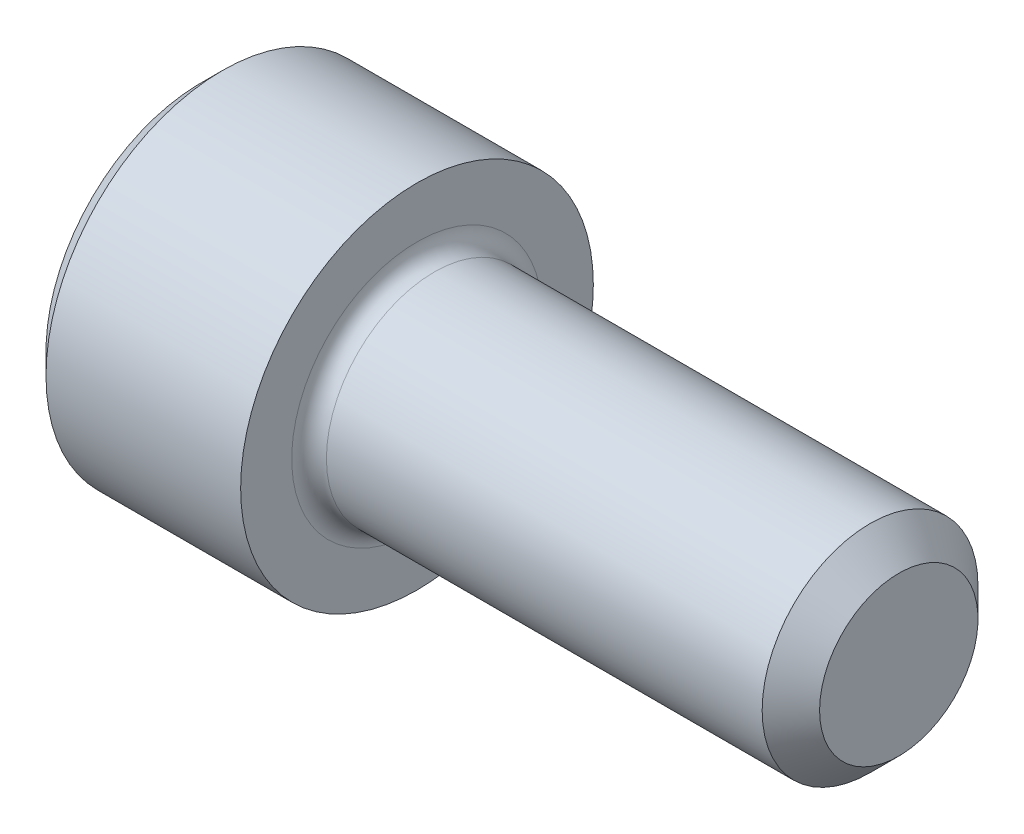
ISO-10303-21;
HEADER;
FILE_DESCRIPTION(('STEP AP214'),'2;1');
FILE_NAME('part.step','',(''),(''),'','','');
FILE_SCHEMA(('AUTOMOTIVE_DESIGN { 1 0 10303 214 1 1 1 1 }'));
ENDSEC;
DATA;
#1=APPLICATION_CONTEXT('core data for automotive mechanical design processes');
#2=APPLICATION_PROTOCOL_DEFINITION('international standard','automotive_design',2000,#1);
#3=PRODUCT_CONTEXT('',#1,'mechanical');
#4=PRODUCT('Part','Part','',(#3));
#5=PRODUCT_RELATED_PRODUCT_CATEGORY('part','',(#4));
#6=PRODUCT_DEFINITION_FORMATION('','',#4);
#7=PRODUCT_DEFINITION_CONTEXT('part definition',#1,'design');
#8=PRODUCT_DEFINITION('design','',#6,#7);
#9=PRODUCT_DEFINITION_SHAPE('','',#8);
#10=(LENGTH_UNIT() NAMED_UNIT(*) SI_UNIT(.MILLI.,.METRE.));
#11=(NAMED_UNIT(*) PLANE_ANGLE_UNIT() SI_UNIT($,.RADIAN.));
#12=(NAMED_UNIT(*) SI_UNIT($,.STERADIAN.) SOLID_ANGLE_UNIT());
#13=UNCERTAINTY_MEASURE_WITH_UNIT(LENGTH_MEASURE(1.E-05),#10,'distance_accuracy_value','');
#14=(GEOMETRIC_REPRESENTATION_CONTEXT(3) GLOBAL_UNCERTAINTY_ASSIGNED_CONTEXT((#13)) GLOBAL_UNIT_ASSIGNED_CONTEXT((#10,
#11,#12)) REPRESENTATION_CONTEXT('',''));
#15=CARTESIAN_POINT('',(0.,0.,0.));
#16=DIRECTION('',(0.,0.,1.));
#17=DIRECTION('',(1.,0.,0.));
#18=AXIS2_PLACEMENT_3D('',#15,#16,#17);
#19=CARTESIAN_POINT('',(0.,0.,0.));
#20=DIRECTION('',(-0.999999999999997,0.,0.));
#21=DIRECTION('',(0.,0.,1.));
#22=AXIS2_PLACEMENT_3D('',#19,#20,#21);
#23=PLANE('',#22);
#24=DIRECTION('',(0.,-0.5,0.866025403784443));
#25=VECTOR('',#24,1.);
#26=CARTESIAN_POINT('',(0.,1.37848150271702,-1.52655665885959E-13));
#27=LINE('',#26,#25);
#28=CARTESIAN_POINT('',(0.,1.37848150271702,-1.52655665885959E-13));
#29=VERTEX_POINT('',#28);
#30=CARTESIAN_POINT('',(0.,0.689240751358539,1.19380000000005));
#31=VERTEX_POINT('',#30);
#32=EDGE_CURVE('E315',#29,#31,#27,.T.);
#33=ORIENTED_EDGE('',*,*,#32,.T.);
#34=DIRECTION('',(0.,1.00000000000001,0.));
#35=VECTOR('',#34,1.);
#36=CARTESIAN_POINT('',(2.32452945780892E-13,-0.689240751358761,1.19380000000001));
#37=LINE('',#36,#35);
#38=CARTESIAN_POINT('',(2.32452945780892E-13,-0.689240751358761,1.19380000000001));
#39=VERTEX_POINT('',#38);
#40=EDGE_CURVE('E169',#39,#31,#37,.T.);
#41=ORIENTED_EDGE('',*,*,#40,.F.);
#42=DIRECTION('',(0.,-0.500000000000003,-0.86602540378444));
#43=VECTOR('',#42,1.);
#44=CARTESIAN_POINT('',(2.32452945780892E-13,-0.689240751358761,1.19380000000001));
#45=LINE('',#44,#43);
#46=CARTESIAN_POINT('',(0.,-1.37848150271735,0.));
#47=VERTEX_POINT('',#46);
#48=EDGE_CURVE('E319',#39,#47,#45,.T.);
#49=ORIENTED_EDGE('',*,*,#48,.T.);
#50=DIRECTION('',(0.,0.5,-0.866025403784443));
#51=VECTOR('',#50,1.);
#52=CARTESIAN_POINT('',(0.,-1.37848150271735,0.));
#53=LINE('',#52,#51);
#54=CARTESIAN_POINT('',(0.,-0.689240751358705,-1.19379999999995));
#55=VERTEX_POINT('',#54);
#56=EDGE_CURVE('E322',#47,#55,#53,.T.);
#57=ORIENTED_EDGE('',*,*,#56,.T.);
#58=DIRECTION('',(0.,-1.00000000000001,0.));
#59=VECTOR('',#58,1.);
#60=CARTESIAN_POINT('',(0.,0.689240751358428,-1.19380000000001));
#61=LINE('',#60,#59);
#62=CARTESIAN_POINT('',(0.,0.689240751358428,-1.19380000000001));
#63=VERTEX_POINT('',#62);
#64=EDGE_CURVE('E325',#63,#55,#61,.T.);
#65=ORIENTED_EDGE('',*,*,#64,.F.);
#66=DIRECTION('',(0.,-0.500000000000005,-0.866025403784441));
#67=VECTOR('',#66,1.);
#68=CARTESIAN_POINT('',(0.,1.37848150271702,-1.52655665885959E-13));
#69=LINE('',#68,#67);
#70=EDGE_CURVE('E164',#29,#63,#69,.T.);
#71=ORIENTED_EDGE('',*,*,#70,.F.);
#72=EDGE_LOOP('',(#33,#41,#49,#57,#65,#71));
#73=FACE_BOUND('',#72,.T.);
#74=CARTESIAN_POINT('',(0.,0.,0.));
#75=DIRECTION('',(-0.999999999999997,0.,0.));
#76=DIRECTION('',(0.,0.,1.));
#77=AXIS2_PLACEMENT_3D('',#74,#75,#76);
#78=CIRCLE('',#77,2.0447);
#79=CARTESIAN_POINT('',(0.,0.,-2.0447));
#80=VERTEX_POINT('',#79);
#81=EDGE_CURVE('E202',#80,#80,#78,.T.);
#82=ORIENTED_EDGE('',*,*,#81,.T.);
#83=EDGE_LOOP('',(#82));
#84=FACE_BOUND('',#83,.T.);
#85=ADVANCED_FACE('F54',(#73,#84),#23,.T.);
#86=CARTESIAN_POINT('',(0.,0.,0.));
#87=DIRECTION('',(0.999999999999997,0.,0.));
#88=DIRECTION('',(0.,0.,-1.));
#89=AXIS2_PLACEMENT_3D('',#86,#87,#88);
#90=CONICAL_SURFACE('',#89,2.0447,0.785398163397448);
#91=CARTESIAN_POINT('',(0.279400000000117,-2.22044604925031E-13,0.));
#92=DIRECTION('',(-0.999999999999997,0.,0.));
#93=DIRECTION('',(0.,0.,1.));
#94=AXIS2_PLACEMENT_3D('',#91,#92,#93);
#95=CIRCLE('',#94,2.3241);
#96=CARTESIAN_POINT('',(0.279400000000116,0.,-2.32410000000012));
#97=VERTEX_POINT('',#96);
#98=EDGE_CURVE('E198',#97,#97,#95,.T.);
#99=CARTESIAN_POINT('',(0.279400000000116,0.,-2.32410000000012));
#100=CARTESIAN_POINT('',(0.276489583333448,0.,-2.32118958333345));
#101=CARTESIAN_POINT('',(0.273579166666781,0.,-2.31827916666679));
#102=CARTESIAN_POINT('',(0.267758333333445,0.,-2.31245833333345));
#103=CARTESIAN_POINT('',(0.264847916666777,0.,-2.30954791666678));
#104=CARTESIAN_POINT('',(0.259027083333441,0.,-2.30372708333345));
#105=CARTESIAN_POINT('',(0.256116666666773,0.,-2.30081666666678));
#106=CARTESIAN_POINT('',(0.250295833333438,0.,-2.29499583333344));
#107=CARTESIAN_POINT('',(0.24738541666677,0.,-2.29208541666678));
#108=CARTESIAN_POINT('',(0.241564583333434,0.,-2.28626458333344));
#109=CARTESIAN_POINT('',(0.238654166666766,0.,-2.28335416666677));
#110=CARTESIAN_POINT('',(0.23283333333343,0.,-2.27753333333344));
#111=CARTESIAN_POINT('',(0.229922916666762,0.,-2.27462291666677));
#112=CARTESIAN_POINT('',(0.224102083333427,0.,-2.26880208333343));
#113=CARTESIAN_POINT('',(0.221191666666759,0.,-2.26589166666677));
#114=CARTESIAN_POINT('',(0.215370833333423,0.,-2.26007083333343));
#115=CARTESIAN_POINT('',(0.212460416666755,0.,-2.25716041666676));
#116=CARTESIAN_POINT('',(0.206639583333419,0.,-2.25133958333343));
#117=CARTESIAN_POINT('',(0.203729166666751,0.,-2.24842916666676));
#118=CARTESIAN_POINT('',(0.197908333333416,0.,-2.24260833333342));
#119=CARTESIAN_POINT('',(0.194997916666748,0.,-2.23969791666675));
#120=CARTESIAN_POINT('',(0.189177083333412,0.,-2.23387708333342));
#121=CARTESIAN_POINT('',(0.186266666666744,0.,-2.23096666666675));
#122=CARTESIAN_POINT('',(0.180445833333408,0.,-2.22514583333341));
#123=CARTESIAN_POINT('',(0.17753541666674,0.,-2.22223541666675));
#124=CARTESIAN_POINT('',(0.171714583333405,0.,-2.21641458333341));
#125=CARTESIAN_POINT('',(0.168804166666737,0.,-2.21350416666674));
#126=CARTESIAN_POINT('',(0.162983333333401,0.,-2.20768333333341));
#127=CARTESIAN_POINT('',(0.160072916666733,0.,-2.20477291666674));
#128=CARTESIAN_POINT('',(0.154252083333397,0.,-2.1989520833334));
#129=CARTESIAN_POINT('',(0.15134166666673,0.,-2.19604166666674));
#130=CARTESIAN_POINT('',(0.145520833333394,0.,-2.1902208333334));
#131=CARTESIAN_POINT('',(0.142610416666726,0.,-2.18731041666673));
#132=CARTESIAN_POINT('',(0.13678958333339,0.,-2.1814895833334));
#133=CARTESIAN_POINT('',(0.133879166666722,0.,-2.17857916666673));
#134=CARTESIAN_POINT('',(0.128058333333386,0.,-2.17275833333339));
#135=CARTESIAN_POINT('',(0.125147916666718,0.,-2.16984791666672));
#136=CARTESIAN_POINT('',(0.119327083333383,0.,-2.16402708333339));
#137=CARTESIAN_POINT('',(0.116416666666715,0.,-2.16111666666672));
#138=CARTESIAN_POINT('',(0.110595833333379,0.,-2.15529583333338));
#139=CARTESIAN_POINT('',(0.107685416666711,0.,-2.15238541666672));
#140=CARTESIAN_POINT('',(0.101864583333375,0.,-2.14656458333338));
#141=CARTESIAN_POINT('',(0.0989541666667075,0.,-2.14365416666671));
#142=CARTESIAN_POINT('',(0.0931333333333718,0.,-2.13783333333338));
#143=CARTESIAN_POINT('',(0.0902229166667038,0.,-2.13492291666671));
#144=CARTESIAN_POINT('',(0.0844020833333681,0.,-2.12910208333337));
#145=CARTESIAN_POINT('',(0.0814916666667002,0.,-2.12619166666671));
#146=CARTESIAN_POINT('',(0.0756708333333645,0.,-2.12037083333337));
#147=CARTESIAN_POINT('',(0.0727604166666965,0.,-2.1174604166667));
#148=CARTESIAN_POINT('',(0.0669395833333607,0.,-2.11163958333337));
#149=CARTESIAN_POINT('',(0.0640291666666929,0.,-2.1087291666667));
#150=CARTESIAN_POINT('',(0.0582083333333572,0.,-2.10290833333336));
#151=CARTESIAN_POINT('',(0.0552979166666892,0.,-2.0999979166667));
#152=CARTESIAN_POINT('',(0.0494770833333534,0.,-2.09417708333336));
#153=CARTESIAN_POINT('',(0.0465666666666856,0.,-2.09126666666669));
#154=CARTESIAN_POINT('',(0.0407458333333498,0.,-2.08544583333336));
#155=CARTESIAN_POINT('',(0.037835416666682,0.,-2.08253541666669));
#156=CARTESIAN_POINT('',(0.0320145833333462,0.,-2.07671458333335));
#157=CARTESIAN_POINT('',(0.0291041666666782,0.,-2.07380416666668));
#158=CARTESIAN_POINT('',(0.0232833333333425,0.,-2.06798333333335));
#159=CARTESIAN_POINT('',(0.0203729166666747,0.,-2.06507291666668));
#160=CARTESIAN_POINT('',(0.0145520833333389,0.,-2.05925208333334));
#161=CARTESIAN_POINT('',(0.011641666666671,0.,-2.05634166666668));
#162=CARTESIAN_POINT('',(0.00582083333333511,0.,-2.05052083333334));
#163=CARTESIAN_POINT('',(0.00291041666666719,0.,-2.04761041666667));
#164=CARTESIAN_POINT('',(0.,0.,-2.0447));
#165=B_SPLINE_CURVE_WITH_KNOTS('',3,(#99,#100,#101,#102,#103,#104,#105,#106,#107,#108,#109,#110,
#111,#112,#113,#114,#115,#116,#117,#118,#119,#120,#121,#122,#123,#124,#125,#126,#127,#128,#129,
#130,#131,#132,#133,#134,#135,#136,#137,#138,#139,#140,#141,#142,#143,#144,#145,#146,#147,#148,
#149,#150,#151,#152,#153,#154,#155,#156,#157,#158,#159,#160,#161,#162,#163,#164),.UNSPECIFIED.,
.F.,.F.,(4,2,2,2,2,2,2,2,2,2,2,2,2,2,2,2,2,2,2,2,2,2,2,2,2,2,2,2,2,2,2,2,4),(0.,
0.0123478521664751,0.0246957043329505,0.0370435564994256,0.049391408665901,0.0617392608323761,
0.0740871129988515,0.0864349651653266,0.098782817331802,0.111130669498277,0.123478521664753,
0.135826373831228,0.148174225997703,0.160522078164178,0.172869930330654,0.185217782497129,
0.197565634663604,0.20991348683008,0.222261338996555,0.23460919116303,0.246957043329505,
0.259304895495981,0.271652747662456,0.284000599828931,0.296348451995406,0.308696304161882,
0.321044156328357,0.333392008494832,0.345739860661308,0.358087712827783,0.370435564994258,
0.382783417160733,0.395131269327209),.UNSPECIFIED.);
#166=EDGE_CURVE('BSEAM226',#97,#80,#165,.T.);
#167=ORIENTED_EDGE('',*,*,#98,.T.);
#168=ORIENTED_EDGE('',*,*,#81,.F.);
#169=ORIENTED_EDGE('',*,*,#166,.T.);
#170=ORIENTED_EDGE('',*,*,#166,.F.);
#171=EDGE_LOOP('',(#167,#169,#168,#170));
#172=FACE_BOUND('',#171,.T.);
#173=ADVANCED_FACE('F226',(#172),#90,.T.);
#174=CARTESIAN_POINT('',(-31.7499999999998,-2.4980018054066E-13,-2.22044604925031E-13));
#175=DIRECTION('',(-0.999999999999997,0.,0.));
#176=DIRECTION('',(0.,0.,1.));
#177=AXIS2_PLACEMENT_3D('',#174,#175,#176);
#178=CYLINDRICAL_SURFACE('',#177,2.3241);
#179=CARTESIAN_POINT('',(2.8448,0.,-1.11022302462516E-13));
#180=DIRECTION('',(-0.999999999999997,0.,0.));
#181=DIRECTION('',(0.,0.,1.));
#182=AXIS2_PLACEMENT_3D('',#179,#180,#181);
#183=CIRCLE('',#182,2.3241);
#184=CARTESIAN_POINT('',(2.8448,0.,2.32409999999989));
#185=VERTEX_POINT('',#184);
#186=EDGE_CURVE('E194',#185,#185,#183,.T.);
#187=ORIENTED_EDGE('',*,*,#186,.T.);
#188=EDGE_LOOP('',(#187));
#189=FACE_BOUND('',#188,.T.);
#190=ORIENTED_EDGE('',*,*,#98,.F.);
#191=EDGE_LOOP('',(#190));
#192=FACE_BOUND('',#191,.T.);
#193=ADVANCED_FACE('F231',(#189,#192),#178,.T.);
#194=CARTESIAN_POINT('',(2.84480000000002,2.32409999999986,-1.11022302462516E-13));
#195=DIRECTION('',(0.999999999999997,0.,0.));
#196=DIRECTION('',(0.,0.,-1.));
#197=AXIS2_PLACEMENT_3D('',#194,#195,#196);
#198=PLANE('',#197);
#199=CARTESIAN_POINT('',(2.8448,0.,-1.11022302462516E-13));
#200=DIRECTION('',(0.999999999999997,0.,0.));
#201=DIRECTION('',(0.,0.,-1.));
#202=AXIS2_PLACEMENT_3D('',#199,#200,#201);
#203=CIRCLE('',#202,1.65099999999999);
#204=CARTESIAN_POINT('',(2.8448,0.,-1.65100000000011));
#205=VERTEX_POINT('',#204);
#206=EDGE_CURVE('E63',#205,#205,#203,.F.);
#207=ORIENTED_EDGE('',*,*,#206,.T.);
#208=EDGE_LOOP('',(#207));
#209=FACE_BOUND('',#208,.T.);
#210=ORIENTED_EDGE('',*,*,#186,.F.);
#211=EDGE_LOOP('',(#210));
#212=FACE_BOUND('',#211,.T.);
#213=ADVANCED_FACE('F210',(#209,#212),#198,.T.);
#214=CARTESIAN_POINT('',(-31.7499999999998,-2.4980018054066E-13,-2.22044604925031E-13));
#215=DIRECTION('',(-0.999999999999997,0.,0.));
#216=DIRECTION('',(0.,0.,1.));
#217=AXIS2_PLACEMENT_3D('',#214,#215,#216);
#218=CYLINDRICAL_SURFACE('',#217,1.42239999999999);
#219=CARTESIAN_POINT('',(3.07340000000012,-2.4980018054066E-13,-1.94289029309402E-13));
#220=DIRECTION('',(0.999999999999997,0.,0.));
#221=DIRECTION('',(0.,0.,-1.));
#222=AXIS2_PLACEMENT_3D('',#219,#220,#221);
#223=CIRCLE('',#222,1.42239999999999);
#224=CARTESIAN_POINT('',(3.07340000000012,-2.88047556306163E-13,1.42239999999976));
#225=VERTEX_POINT('',#224);
#226=EDGE_CURVE('E13',#225,#225,#223,.T.);
#227=CARTESIAN_POINT('',(8.8163400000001,0.,0.));
#228=DIRECTION('',(-0.999999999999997,0.,0.));
#229=DIRECTION('',(0.,0.,1.));
#230=AXIS2_PLACEMENT_3D('',#227,#228,#229);
#231=CIRCLE('',#230,1.42239999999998);
#232=CARTESIAN_POINT('',(8.8163400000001,-2.94250992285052E-13,1.42239999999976));
#233=VERTEX_POINT('',#232);
#234=EDGE_CURVE('E190',#233,#233,#231,.T.);
#235=CARTESIAN_POINT('',(3.07340000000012,-2.88047556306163E-13,1.42239999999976));
#236=CARTESIAN_POINT('',(3.13322229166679,-2.88112175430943E-13,1.42239999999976));
#237=CARTESIAN_POINT('',(3.19304458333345,-2.88176794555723E-13,1.42239999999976));
#238=CARTESIAN_POINT('',(3.31268916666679,-2.88306032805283E-13,1.42239999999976));
#239=CARTESIAN_POINT('',(3.37251145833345,-2.88370651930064E-13,1.42239999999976));
#240=CARTESIAN_POINT('',(3.49215604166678,-2.88499890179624E-13,1.42239999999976));
#241=CARTESIAN_POINT('',(3.55197833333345,-2.88564509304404E-13,1.42239999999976));
#242=CARTESIAN_POINT('',(3.67162291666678,-2.88693747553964E-13,1.42239999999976));
#243=CARTESIAN_POINT('',(3.73144520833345,-2.88758366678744E-13,1.42239999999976));
#244=CARTESIAN_POINT('',(3.85108979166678,-2.88887604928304E-13,1.42239999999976));
#245=CARTESIAN_POINT('',(3.91091208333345,-2.88952224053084E-13,1.42239999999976));
#246=CARTESIAN_POINT('',(4.03055666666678,-2.89081462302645E-13,1.42239999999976));
#247=CARTESIAN_POINT('',(4.09037895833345,-2.89146081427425E-13,1.42239999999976));
#248=CARTESIAN_POINT('',(4.21002354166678,-2.89275319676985E-13,1.42239999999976));
#249=CARTESIAN_POINT('',(4.26984583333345,-2.89339938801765E-13,1.42239999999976));
#250=CARTESIAN_POINT('',(4.38949041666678,-2.89469177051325E-13,1.42239999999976));
#251=CARTESIAN_POINT('',(4.44931270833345,-2.89533796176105E-13,1.42239999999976));
#252=CARTESIAN_POINT('',(4.56895729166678,-2.89663034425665E-13,1.42239999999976));
#253=CARTESIAN_POINT('',(4.62877958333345,-2.89727653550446E-13,1.42239999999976));
#254=CARTESIAN_POINT('',(4.74842416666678,-2.89856891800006E-13,1.42239999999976));
#255=CARTESIAN_POINT('',(4.80824645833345,-2.89921510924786E-13,1.42239999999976));
#256=CARTESIAN_POINT('',(4.92789104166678,-2.90050749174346E-13,1.42239999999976));
#257=CARTESIAN_POINT('',(4.98771333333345,-2.90115368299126E-13,1.42239999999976));
#258=CARTESIAN_POINT('',(5.10735791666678,-2.90244606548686E-13,1.42239999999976));
#259=CARTESIAN_POINT('',(5.16718020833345,-2.90309225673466E-13,1.42239999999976));
#260=CARTESIAN_POINT('',(5.28682479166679,-2.90438463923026E-13,1.42239999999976));
#261=CARTESIAN_POINT('',(5.34664708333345,-2.90503083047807E-13,1.42239999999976));
#262=CARTESIAN_POINT('',(5.46629166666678,-2.90632321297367E-13,1.42239999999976));
#263=CARTESIAN_POINT('',(5.52611395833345,-2.90696940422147E-13,1.42239999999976));
#264=CARTESIAN_POINT('',(5.64575854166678,-2.90826178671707E-13,1.42239999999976));
#265=CARTESIAN_POINT('',(5.70558083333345,-2.90890797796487E-13,1.42239999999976));
#266=CARTESIAN_POINT('',(5.82522541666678,-2.91020036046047E-13,1.42239999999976));
#267=CARTESIAN_POINT('',(5.88504770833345,-2.91084655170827E-13,1.42239999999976));
#268=CARTESIAN_POINT('',(6.00469229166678,-2.91213893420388E-13,1.42239999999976));
#269=CARTESIAN_POINT('',(6.06451458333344,-2.91278512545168E-13,1.42239999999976));
#270=CARTESIAN_POINT('',(6.18415916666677,-2.91407750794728E-13,1.42239999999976));
#271=CARTESIAN_POINT('',(6.24398145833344,-2.91472369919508E-13,1.42239999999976));
#272=CARTESIAN_POINT('',(6.36362604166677,-2.91601608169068E-13,1.42239999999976));
#273=CARTESIAN_POINT('',(6.42344833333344,-2.91666227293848E-13,1.42239999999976));
#274=CARTESIAN_POINT('',(6.54309291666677,-2.91795465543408E-13,1.42239999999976));
#275=CARTESIAN_POINT('',(6.60291520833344,-2.91860084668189E-13,1.42239999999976));
#276=CARTESIAN_POINT('',(6.72255979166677,-2.91989322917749E-13,1.42239999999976));
#277=CARTESIAN_POINT('',(6.78238208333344,-2.92053942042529E-13,1.42239999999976));
#278=CARTESIAN_POINT('',(6.90202666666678,-2.92183180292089E-13,1.42239999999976));
#279=CARTESIAN_POINT('',(6.96184895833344,-2.92247799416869E-13,1.42239999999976));
#280=CARTESIAN_POINT('',(7.08149354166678,-2.92377037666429E-13,1.42239999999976));
#281=CARTESIAN_POINT('',(7.14131583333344,-2.92441656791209E-13,1.42239999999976));
#282=CARTESIAN_POINT('',(7.26096041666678,-2.92570895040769E-13,1.42239999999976));
#283=CARTESIAN_POINT('',(7.32078270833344,-2.9263551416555E-13,1.42239999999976));
#284=CARTESIAN_POINT('',(7.44042729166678,-2.9276475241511E-13,1.42239999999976));
#285=CARTESIAN_POINT('',(7.50024958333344,-2.9282937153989E-13,1.42239999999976));
#286=CARTESIAN_POINT('',(7.61989416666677,-2.9295860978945E-13,1.42239999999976));
#287=CARTESIAN_POINT('',(7.67971645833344,-2.9302322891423E-13,1.42239999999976));
#288=CARTESIAN_POINT('',(7.79936104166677,-2.9315246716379E-13,1.42239999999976));
#289=CARTESIAN_POINT('',(7.85918333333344,-2.9321708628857E-13,1.42239999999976));
#290=CARTESIAN_POINT('',(7.97882791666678,-2.93346324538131E-13,1.42239999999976));
#291=CARTESIAN_POINT('',(8.03865020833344,-2.93410943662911E-13,1.42239999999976));
#292=CARTESIAN_POINT('',(8.15829479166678,-2.93540181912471E-13,1.42239999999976));
#293=CARTESIAN_POINT('',(8.21811708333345,-2.93604801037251E-13,1.42239999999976));
#294=CARTESIAN_POINT('',(8.33776166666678,-2.93734039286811E-13,1.42239999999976));
#295=CARTESIAN_POINT('',(8.39758395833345,-2.93798658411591E-13,1.42239999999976));
#296=CARTESIAN_POINT('',(8.51722854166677,-2.93927896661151E-13,1.42239999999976));
#297=CARTESIAN_POINT('',(8.57705083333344,-2.93992515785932E-13,1.42239999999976));
#298=CARTESIAN_POINT('',(8.69669541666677,-2.94121754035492E-13,1.42239999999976));
#299=CARTESIAN_POINT('',(8.75651770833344,-2.94186373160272E-13,1.42239999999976));
#300=CARTESIAN_POINT('',(8.8163400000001,-2.94250992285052E-13,1.42239999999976));
#301=B_SPLINE_CURVE_WITH_KNOTS('',3,(#235,#236,#237,#238,#239,#240,#241,#242,#243,#244,#245,
#246,#247,#248,#249,#250,#251,#252,#253,#254,#255,#256,#257,#258,#259,#260,#261,#262,#263,#264,
#265,#266,#267,#268,#269,#270,#271,#272,#273,#274,#275,#276,#277,#278,#279,#280,#281,#282,#283,
#284,#285,#286,#287,#288,#289,#290,#291,#292,#293,#294,#295,#296,#297,#298,#299,#300),
.UNSPECIFIED.,.F.,.F.,(4,2,2,2,2,2,2,2,2,2,2,2,2,2,2,2,2,2,2,2,2,2,2,2,2,2,2,2,2,2,2,2,4),(0.,
0.179466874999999,0.358933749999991,0.538400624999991,0.71786749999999,0.897334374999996,
1.07680125,1.25626812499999,1.43573499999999,1.61520187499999,1.79466874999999,1.97413562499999,
2.1536025,2.333069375,2.51253625,2.69200312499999,2.87146999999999,3.05093687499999,
3.23040374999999,3.40987062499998,3.58933749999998,3.76880437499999,3.94827124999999,
4.12773812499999,4.30720499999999,4.48667187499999,4.66613874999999,4.84560562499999,
5.02507249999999,5.20453937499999,5.38400624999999,5.56347312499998,5.74293999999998),.UNSPECIFIED.);
#302=EDGE_CURVE('BSEAM241',#225,#233,#301,.T.);
#303=ORIENTED_EDGE('',*,*,#226,.T.);
#304=ORIENTED_EDGE('',*,*,#234,.T.);
#305=ORIENTED_EDGE('',*,*,#302,.T.);
#306=ORIENTED_EDGE('',*,*,#302,.F.);
#307=EDGE_LOOP('',(#303,#305,#304,#306));
#308=FACE_BOUND('',#307,.T.);
#309=ADVANCED_FACE('F241',(#308),#218,.T.);
#310=CARTESIAN_POINT('',(9.19480000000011,-1.38777878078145E-13,0.));
#311=DIRECTION('',(-0.999999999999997,0.,0.));
#312=DIRECTION('',(0.,0.,1.));
#313=AXIS2_PLACEMENT_3D('',#310,#311,#312);
#314=CONICAL_SURFACE('',#313,1.04394,0.78539816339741);
#315=CARTESIAN_POINT('',(9.19480000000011,-1.38777878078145E-13,0.));
#316=DIRECTION('',(-0.999999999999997,0.,0.));
#317=DIRECTION('',(0.,0.,1.));
#318=AXIS2_PLACEMENT_3D('',#315,#316,#317);
#319=CIRCLE('',#318,1.04394);
#320=CARTESIAN_POINT('',(9.19480000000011,-1.39241479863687E-13,1.0439400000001));
#321=VERTEX_POINT('',#320);
#322=EDGE_CURVE('E185',#321,#321,#319,.T.);
#323=CARTESIAN_POINT('',(8.81634000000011,-1.39000742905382E-13,1.42240000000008));
#324=CARTESIAN_POINT('',(8.82028229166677,-1.39003250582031E-13,1.41845770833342));
#325=CARTESIAN_POINT('',(8.82422458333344,-1.3900575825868E-13,1.41451541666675));
#326=CARTESIAN_POINT('',(8.83210916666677,-1.39010773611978E-13,1.40663083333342));
#327=CARTESIAN_POINT('',(8.83605145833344,-1.39013281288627E-13,1.40268854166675));
#328=CARTESIAN_POINT('',(8.84393604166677,-1.39018296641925E-13,1.39480395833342));
#329=CARTESIAN_POINT('',(8.84787833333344,-1.39020804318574E-13,1.39086166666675));
#330=CARTESIAN_POINT('',(8.85576291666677,-1.39025819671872E-13,1.38297708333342));
#331=CARTESIAN_POINT('',(8.85970520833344,-1.39028327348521E-13,1.37903479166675));
#332=CARTESIAN_POINT('',(8.86758979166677,-1.39033342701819E-13,1.37115020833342));
#333=CARTESIAN_POINT('',(8.87153208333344,-1.39035850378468E-13,1.36720791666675));
#334=CARTESIAN_POINT('',(8.87941666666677,-1.39040865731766E-13,1.35932333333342));
#335=CARTESIAN_POINT('',(8.88335895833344,-1.39043373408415E-13,1.35538104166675));
#336=CARTESIAN_POINT('',(8.89124354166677,-1.39048388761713E-13,1.34749645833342));
#337=CARTESIAN_POINT('',(8.89518583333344,-1.39050896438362E-13,1.34355416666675));
#338=CARTESIAN_POINT('',(8.90307041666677,-1.3905591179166E-13,1.33566958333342));
#339=CARTESIAN_POINT('',(8.90701270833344,-1.39058419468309E-13,1.33172729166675));
#340=CARTESIAN_POINT('',(8.91489729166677,-1.39063434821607E-13,1.32384270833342));
#341=CARTESIAN_POINT('',(8.91883958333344,-1.39065942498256E-13,1.31990041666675));
#342=CARTESIAN_POINT('',(8.92672416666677,-1.39070957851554E-13,1.31201583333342));
#343=CARTESIAN_POINT('',(8.93066645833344,-1.39073465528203E-13,1.30807354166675));
#344=CARTESIAN_POINT('',(8.93855104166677,-1.39078480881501E-13,1.30018895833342));
#345=CARTESIAN_POINT('',(8.94249333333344,-1.3908098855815E-13,1.29624666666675));
#346=CARTESIAN_POINT('',(8.95037791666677,-1.39086003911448E-13,1.28836208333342));
#347=CARTESIAN_POINT('',(8.95432020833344,-1.39088511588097E-13,1.28441979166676));
#348=CARTESIAN_POINT('',(8.96220479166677,-1.39093526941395E-13,1.27653520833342));
#349=CARTESIAN_POINT('',(8.96614708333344,-1.39096034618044E-13,1.27259291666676));
#350=CARTESIAN_POINT('',(8.97403166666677,-1.39101049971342E-13,1.26470833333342));
#351=CARTESIAN_POINT('',(8.97797395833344,-1.39103557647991E-13,1.26076604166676));
#352=CARTESIAN_POINT('',(8.98585854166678,-1.39108573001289E-13,1.25288145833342));
#353=CARTESIAN_POINT('',(8.98980083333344,-1.39111080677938E-13,1.24893916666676));
#354=CARTESIAN_POINT('',(8.99768541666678,-1.39116096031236E-13,1.24105458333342));
#355=CARTESIAN_POINT('',(9.00162770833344,-1.39118603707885E-13,1.23711229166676));
#356=CARTESIAN_POINT('',(9.00951229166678,-1.39123619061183E-13,1.22922770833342));
#357=CARTESIAN_POINT('',(9.01345458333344,-1.39126126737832E-13,1.22528541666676));
#358=CARTESIAN_POINT('',(9.02133916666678,-1.3913114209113E-13,1.21740083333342));
#359=CARTESIAN_POINT('',(9.02528145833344,-1.39133649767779E-13,1.21345854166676));
#360=CARTESIAN_POINT('',(9.03316604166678,-1.39138665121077E-13,1.20557395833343));
#361=CARTESIAN_POINT('',(9.03710833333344,-1.39141172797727E-13,1.20163166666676));
#362=CARTESIAN_POINT('',(9.04499291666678,-1.39146188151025E-13,1.19374708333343));
#363=CARTESIAN_POINT('',(9.04893520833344,-1.39148695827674E-13,1.18980479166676));
#364=CARTESIAN_POINT('',(9.05681979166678,-1.39153711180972E-13,1.18192020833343));
#365=CARTESIAN_POINT('',(9.06076208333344,-1.39156218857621E-13,1.17797791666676));
#366=CARTESIAN_POINT('',(9.06864666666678,-1.39161234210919E-13,1.17009333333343));
#367=CARTESIAN_POINT('',(9.07258895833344,-1.39163741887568E-13,1.16615104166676));
#368=CARTESIAN_POINT('',(9.08047354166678,-1.39168757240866E-13,1.15826645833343));
#369=CARTESIAN_POINT('',(9.08441583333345,-1.39171264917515E-13,1.15432416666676));
#370=CARTESIAN_POINT('',(9.09230041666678,-1.39176280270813E-13,1.14643958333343));
#371=CARTESIAN_POINT('',(9.09624270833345,-1.39178787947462E-13,1.14249729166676));
#372=CARTESIAN_POINT('',(9.10412729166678,-1.3918380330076E-13,1.13461270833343));
#373=CARTESIAN_POINT('',(9.10806958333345,-1.39186310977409E-13,1.13067041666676));
#374=CARTESIAN_POINT('',(9.11595416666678,-1.39191326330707E-13,1.12278583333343));
#375=CARTESIAN_POINT('',(9.11989645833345,-1.39193834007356E-13,1.11884354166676));
#376=CARTESIAN_POINT('',(9.12778104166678,-1.39198849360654E-13,1.11095895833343));
#377=CARTESIAN_POINT('',(9.13172333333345,-1.39201357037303E-13,1.10701666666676));
#378=CARTESIAN_POINT('',(9.13960791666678,-1.39206372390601E-13,1.09913208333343));
#379=CARTESIAN_POINT('',(9.14355020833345,-1.3920888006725E-13,1.09518979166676));
#380=CARTESIAN_POINT('',(9.15143479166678,-1.39213895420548E-13,1.08730520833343));
#381=CARTESIAN_POINT('',(9.15537708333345,-1.39216403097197E-13,1.08336291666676));
#382=CARTESIAN_POINT('',(9.16326166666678,-1.39221418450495E-13,1.07547833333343));
#383=CARTESIAN_POINT('',(9.16720395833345,-1.39223926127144E-13,1.07153604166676));
#384=CARTESIAN_POINT('',(9.17508854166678,-1.39228941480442E-13,1.06365145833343));
#385=CARTESIAN_POINT('',(9.17903083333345,-1.39231449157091E-13,1.05970916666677));
#386=CARTESIAN_POINT('',(9.18691541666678,-1.39236464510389E-13,1.05182458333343));
#387=CARTESIAN_POINT('',(9.19085770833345,-1.39238972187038E-13,1.04788229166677));
#388=CARTESIAN_POINT('',(9.19480000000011,-1.39241479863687E-13,1.0439400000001));
#389=B_SPLINE_CURVE_WITH_KNOTS('',3,(#323,#324,#325,#326,#327,#328,#329,#330,#331,#332,#333,
#334,#335,#336,#337,#338,#339,#340,#341,#342,#343,#344,#345,#346,#347,#348,#349,#350,#351,#352,
#353,#354,#355,#356,#357,#358,#359,#360,#361,#362,#363,#364,#365,#366,#367,#368,#369,#370,#371,
#372,#373,#374,#375,#376,#377,#378,#379,#380,#381,#382,#383,#384,#385,#386,#387,#388),
.UNSPECIFIED.,.F.,.F.,(4,2,2,2,2,2,2,2,2,2,2,2,2,2,2,2,2,2,2,2,2,2,2,2,2,2,2,2,2,2,2,2,4),(0.,
0.0167257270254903,0.0334514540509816,0.0501771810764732,0.0669029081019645,0.0836286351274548,
0.100354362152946,0.117080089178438,0.133805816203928,0.15053154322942,0.167257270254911,
0.183982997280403,0.200708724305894,0.217434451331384,0.234160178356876,0.250885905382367,
0.267611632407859,0.284337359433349,0.301063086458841,0.317788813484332,0.334514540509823,
0.351240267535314,0.367965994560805,0.384691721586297,0.401417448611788,0.418143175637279,
0.43486890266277,0.451594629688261,0.468320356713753,0.485046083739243,0.501771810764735,
0.518497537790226,0.535223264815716),.UNSPECIFIED.);
#390=EDGE_CURVE('BSEAM221',#233,#321,#389,.T.);
#391=ORIENTED_EDGE('',*,*,#234,.F.);
#392=ORIENTED_EDGE('',*,*,#322,.T.);
#393=ORIENTED_EDGE('',*,*,#390,.T.);
#394=ORIENTED_EDGE('',*,*,#390,.F.);
#395=EDGE_LOOP('',(#391,#393,#392,#394));
#396=FACE_BOUND('',#395,.T.);
#397=ADVANCED_FACE('F221',(#396),#314,.T.);
#398=CARTESIAN_POINT('',(9.19480000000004,1.04393999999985,-1.2490009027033E-13));
#399=DIRECTION('',(0.999999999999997,0.,0.));
#400=DIRECTION('',(0.,0.,-1.));
#401=AXIS2_PLACEMENT_3D('',#398,#399,#400);
#402=PLANE('',#401);
#403=ORIENTED_EDGE('',*,*,#322,.F.);
#404=EDGE_LOOP('',(#403));
#405=FACE_BOUND('',#404,.T.);
#406=ADVANCED_FACE('F214',(#405),#402,.T.);
#407=CARTESIAN_POINT('',(3.07340000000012,-2.4980018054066E-13,-1.94289029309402E-13));
#408=DIRECTION('',(0.999999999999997,0.,0.));
#409=DIRECTION('',(0.,0.,-1.));
#410=AXIS2_PLACEMENT_3D('',#407,#408,#409);
#411=TOROIDAL_SURFACE('',#410,1.65099999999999,0.2286);
#412=ORIENTED_EDGE('',*,*,#226,.F.);
#413=EDGE_LOOP('',(#412));
#414=FACE_BOUND('',#413,.T.);
#415=ORIENTED_EDGE('',*,*,#206,.F.);
#416=EDGE_LOOP('',(#415));
#417=FACE_BOUND('',#416,.T.);
#418=ADVANCED_FACE('F56',(#414,#417),#411,.F.);
#419=CARTESIAN_POINT('',(1.29540000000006,1.37848150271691,0.));
#420=DIRECTION('',(0.,-0.866025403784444,-0.5));
#421=DIRECTION('',(0.,0.5,-0.866025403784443));
#422=AXIS2_PLACEMENT_3D('',#419,#420,#421);
#423=PLANE('',#422);
#424=ORIENTED_EDGE('',*,*,#32,.F.);
#425=DIRECTION('',(-0.999999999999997,0.,0.));
#426=VECTOR('',#425,1.);
#427=CARTESIAN_POINT('',(1.29540000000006,1.37848150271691,0.));
#428=LINE('',#427,#426);
#429=CARTESIAN_POINT('',(1.29540000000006,1.37848150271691,0.));
#430=VERTEX_POINT('',#429);
#431=EDGE_CURVE('E302',#430,#29,#428,.T.);
#432=ORIENTED_EDGE('',*,*,#431,.F.);
#433=DIRECTION('',(0.,-0.5,0.866025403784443));
#434=VECTOR('',#433,1.);
#435=CARTESIAN_POINT('',(1.29540000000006,1.37848150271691,0.));
#436=LINE('',#435,#434);
#437=CARTESIAN_POINT('',(1.29540000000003,1.03386112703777,0.596899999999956));
#438=VERTEX_POINT('',#437);
#439=EDGE_CURVE('E155',#430,#438,#436,.T.);
#440=ORIENTED_EDGE('',*,*,#439,.T.);
#441=CARTESIAN_POINT('',(1.29540000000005,0.689240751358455,1.1937999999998));
#442=VERTEX_POINT('',#441);
#443=EDGE_CURVE('E145',#438,#442,#436,.T.);
#444=ORIENTED_EDGE('',*,*,#443,.T.);
#445=DIRECTION('',(-0.999999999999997,0.,0.));
#446=VECTOR('',#445,1.);
#447=CARTESIAN_POINT('',(1.29540000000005,0.689240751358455,1.1937999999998));
#448=LINE('',#447,#446);
#449=EDGE_CURVE('E160',#442,#31,#448,.T.);
#450=ORIENTED_EDGE('',*,*,#449,.T.);
#451=EDGE_LOOP('',(#424,#432,#440,#444,#450));
#452=FACE_BOUND('',#451,.T.);
#453=ADVANCED_FACE('F159',(#452),#423,.T.);
#454=CARTESIAN_POINT('',(1.29540000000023,-0.689240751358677,1.19379999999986));
#455=DIRECTION('',(0.,0.,1.));
#456=DIRECTION('',(0.,-1.00000000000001,0.));
#457=AXIS2_PLACEMENT_3D('',#454,#455,#456);
#458=PLANE('',#457);
#459=ORIENTED_EDGE('',*,*,#40,.T.);
#460=ORIENTED_EDGE('',*,*,#449,.F.);
#461=DIRECTION('',(0.,1.00000000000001,0.));
#462=VECTOR('',#461,1.);
#463=CARTESIAN_POINT('',(1.29540000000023,-0.689240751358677,1.19379999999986));
#464=LINE('',#463,#462);
#465=CARTESIAN_POINT('',(1.29540000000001,-2.22044604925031E-13,1.19379999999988));
#466=VERTEX_POINT('',#465);
#467=EDGE_CURVE('E142',#466,#442,#464,.T.);
#468=ORIENTED_EDGE('',*,*,#467,.F.);
#469=CARTESIAN_POINT('',(1.29540000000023,-0.689240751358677,1.19379999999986));
#470=VERTEX_POINT('',#469);
#471=EDGE_CURVE('E154',#470,#466,#464,.T.);
#472=ORIENTED_EDGE('',*,*,#471,.F.);
#473=DIRECTION('',(-0.999999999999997,0.,0.));
#474=VECTOR('',#473,1.);
#475=CARTESIAN_POINT('',(1.29540000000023,-0.689240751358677,1.19379999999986));
#476=LINE('',#475,#474);
#477=EDGE_CURVE('E172',#470,#39,#476,.T.);
#478=ORIENTED_EDGE('',*,*,#477,.T.);
#479=EDGE_LOOP('',(#459,#460,#468,#472,#478));
#480=FACE_BOUND('',#479,.T.);
#481=ADVANCED_FACE('F166',(#480),#458,.F.);
#482=CARTESIAN_POINT('',(1.29540000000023,-0.689240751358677,1.19379999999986));
#483=DIRECTION('',(0.,0.866025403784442,-0.500000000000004));
#484=DIRECTION('',(0.,0.500000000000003,0.86602540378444));
#485=AXIS2_PLACEMENT_3D('',#482,#483,#484);
#486=PLANE('',#485);
#487=ORIENTED_EDGE('',*,*,#48,.F.);
#488=ORIENTED_EDGE('',*,*,#477,.F.);
#489=DIRECTION('',(0.,-0.500000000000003,-0.86602540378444));
#490=VECTOR('',#489,1.);
#491=CARTESIAN_POINT('',(1.29540000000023,-0.689240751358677,1.19379999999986));
#492=LINE('',#491,#490);
#493=CARTESIAN_POINT('',(1.29540000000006,-1.03386112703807,0.596899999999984));
#494=VERTEX_POINT('',#493);
#495=EDGE_CURVE('E354',#470,#494,#492,.T.);
#496=ORIENTED_EDGE('',*,*,#495,.T.);
#497=CARTESIAN_POINT('',(1.29540000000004,-1.37848150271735,0.));
#498=VERTEX_POINT('',#497);
#499=EDGE_CURVE('E337',#494,#498,#492,.T.);
#500=ORIENTED_EDGE('',*,*,#499,.T.);
#501=DIRECTION('',(-0.999999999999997,0.,0.));
#502=VECTOR('',#501,1.);
#503=CARTESIAN_POINT('',(1.29540000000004,-1.37848150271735,0.));
#504=LINE('',#503,#502);
#505=EDGE_CURVE('E180',#498,#47,#504,.T.);
#506=ORIENTED_EDGE('',*,*,#505,.T.);
#507=EDGE_LOOP('',(#487,#488,#496,#500,#506));
#508=FACE_BOUND('',#507,.T.);
#509=ADVANCED_FACE('F254',(#508),#486,.T.);
#510=CARTESIAN_POINT('',(1.29540000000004,-1.37848150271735,0.));
#511=DIRECTION('',(0.,0.866025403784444,0.5));
#512=DIRECTION('',(0.,-0.5,0.866025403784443));
#513=AXIS2_PLACEMENT_3D('',#510,#511,#512);
#514=PLANE('',#513);
#515=ORIENTED_EDGE('',*,*,#56,.F.);
#516=ORIENTED_EDGE('',*,*,#505,.F.);
#517=DIRECTION('',(0.,0.5,-0.866025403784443));
#518=VECTOR('',#517,1.);
#519=CARTESIAN_POINT('',(1.29540000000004,-1.37848150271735,0.));
#520=LINE('',#519,#518);
#521=CARTESIAN_POINT('',(1.29540000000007,-1.0338611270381,-0.596899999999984));
#522=VERTEX_POINT('',#521);
#523=EDGE_CURVE('E310',#498,#522,#520,.T.);
#524=ORIENTED_EDGE('',*,*,#523,.T.);
#525=CARTESIAN_POINT('',(1.29539999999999,-0.689240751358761,-1.19380000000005));
#526=VERTEX_POINT('',#525);
#527=EDGE_CURVE('E352',#522,#526,#520,.T.);
#528=ORIENTED_EDGE('',*,*,#527,.T.);
#529=DIRECTION('',(-0.999999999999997,0.,0.));
#530=VECTOR('',#529,1.);
#531=CARTESIAN_POINT('',(1.29539999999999,-0.689240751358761,-1.19380000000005));
#532=LINE('',#531,#530);
#533=EDGE_CURVE('E301',#526,#55,#532,.T.);
#534=ORIENTED_EDGE('',*,*,#533,.T.);
#535=EDGE_LOOP('',(#515,#516,#524,#528,#534));
#536=FACE_BOUND('',#535,.T.);
#537=ADVANCED_FACE('F257',(#536),#514,.T.);
#538=CARTESIAN_POINT('',(1.29540000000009,0.689240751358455,-1.19380000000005));
#539=DIRECTION('',(0.,0.,-1.));
#540=DIRECTION('',(0.,1.00000000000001,0.));
#541=AXIS2_PLACEMENT_3D('',#538,#539,#540);
#542=PLANE('',#541);
#543=ORIENTED_EDGE('',*,*,#64,.T.);
#544=ORIENTED_EDGE('',*,*,#533,.F.);
#545=DIRECTION('',(0.,-1.00000000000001,0.));
#546=VECTOR('',#545,1.);
#547=CARTESIAN_POINT('',(1.29540000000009,0.689240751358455,-1.19380000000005));
#548=LINE('',#547,#546);
#549=CARTESIAN_POINT('',(1.29540000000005,0.,-1.19380000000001));
#550=VERTEX_POINT('',#549);
#551=EDGE_CURVE('E305',#550,#526,#548,.T.);
#552=ORIENTED_EDGE('',*,*,#551,.F.);
#553=CARTESIAN_POINT('',(1.29540000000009,0.689240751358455,-1.19380000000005));
#554=VERTEX_POINT('',#553);
#555=EDGE_CURVE('E73',#554,#550,#548,.T.);
#556=ORIENTED_EDGE('',*,*,#555,.F.);
#557=DIRECTION('',(-0.999999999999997,0.,0.));
#558=VECTOR('',#557,1.);
#559=CARTESIAN_POINT('',(1.29540000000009,0.689240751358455,-1.19380000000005));
#560=LINE('',#559,#558);
#561=EDGE_CURVE('E297',#554,#63,#560,.T.);
#562=ORIENTED_EDGE('',*,*,#561,.T.);
#563=EDGE_LOOP('',(#543,#544,#552,#556,#562));
#564=FACE_BOUND('',#563,.T.);
#565=ADVANCED_FACE('F261',(#564),#542,.F.);
#566=CARTESIAN_POINT('',(1.29540000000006,1.37848150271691,0.));
#567=DIRECTION('',(0.,0.866025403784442,-0.500000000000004));
#568=DIRECTION('',(0.,0.500000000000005,0.866025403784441));
#569=AXIS2_PLACEMENT_3D('',#566,#567,#568);
#570=PLANE('',#569);
#571=ORIENTED_EDGE('',*,*,#70,.T.);
#572=ORIENTED_EDGE('',*,*,#561,.F.);
#573=DIRECTION('',(0.,-0.500000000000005,-0.866025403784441));
#574=VECTOR('',#573,1.);
#575=CARTESIAN_POINT('',(1.29540000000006,1.37848150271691,0.));
#576=LINE('',#575,#574);
#577=CARTESIAN_POINT('',(1.29540000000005,1.03386112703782,-0.596900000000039));
#578=VERTEX_POINT('',#577);
#579=EDGE_CURVE('E286',#578,#554,#576,.T.);
#580=ORIENTED_EDGE('',*,*,#579,.F.);
#581=EDGE_CURVE('E293',#430,#578,#576,.T.);
#582=ORIENTED_EDGE('',*,*,#581,.F.);
#583=ORIENTED_EDGE('',*,*,#431,.T.);
#584=EDGE_LOOP('',(#571,#572,#580,#582,#583));
#585=FACE_BOUND('',#584,.T.);
#586=ADVANCED_FACE('F265',(#585),#570,.F.);
#587=CARTESIAN_POINT('',(1.29540000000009,2.06772225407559,-1.19380000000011));
#588=DIRECTION('',(0.999999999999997,0.,0.));
#589=DIRECTION('',(0.,0.,-1.));
#590=AXIS2_PLACEMENT_3D('',#587,#588,#589);
#591=PLANE('',#590);
#592=ORIENTED_EDGE('',*,*,#551,.T.);
#593=ORIENTED_EDGE('',*,*,#527,.F.);
#594=CARTESIAN_POINT('',(1.29539999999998,-2.22044604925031E-13,-1.80411241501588E-13));
#595=DIRECTION('',(-0.999999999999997,0.,0.));
#596=DIRECTION('',(0.,0.,1.));
#597=AXIS2_PLACEMENT_3D('',#594,#595,#596);
#598=CIRCLE('',#597,1.1938);
#599=EDGE_CURVE('E345',#550,#522,#598,.T.);
#600=ORIENTED_EDGE('',*,*,#599,.F.);
#601=EDGE_LOOP('',(#592,#593,#600));
#602=FACE_BOUND('',#601,.T.);
#603=ADVANCED_FACE('F269',(#602),#591,.F.);
#604=ORIENTED_EDGE('',*,*,#523,.F.);
#605=ORIENTED_EDGE('',*,*,#499,.F.);
#606=EDGE_CURVE('E178',#522,#494,#598,.T.);
#607=ORIENTED_EDGE('',*,*,#606,.F.);
#608=EDGE_LOOP('',(#604,#605,#607));
#609=FACE_BOUND('',#608,.T.);
#610=ADVANCED_FACE('F272',(#609),#591,.F.);
#611=ORIENTED_EDGE('',*,*,#495,.F.);
#612=ORIENTED_EDGE('',*,*,#471,.T.);
#613=EDGE_CURVE('E171',#494,#466,#598,.T.);
#614=ORIENTED_EDGE('',*,*,#613,.F.);
#615=EDGE_LOOP('',(#611,#612,#614));
#616=FACE_BOUND('',#615,.T.);
#617=ADVANCED_FACE('F277',(#616),#591,.F.);
#618=ORIENTED_EDGE('',*,*,#467,.T.);
#619=ORIENTED_EDGE('',*,*,#443,.F.);
#620=EDGE_CURVE('E148',#466,#438,#598,.T.);
#621=ORIENTED_EDGE('',*,*,#620,.F.);
#622=EDGE_LOOP('',(#618,#619,#621));
#623=FACE_BOUND('',#622,.T.);
#624=ADVANCED_FACE('F144',(#623),#591,.F.);
#625=ORIENTED_EDGE('',*,*,#439,.F.);
#626=ORIENTED_EDGE('',*,*,#581,.T.);
#627=EDGE_CURVE('E186',#438,#578,#598,.T.);
#628=ORIENTED_EDGE('',*,*,#627,.F.);
#629=EDGE_LOOP('',(#625,#626,#628));
#630=FACE_BOUND('',#629,.T.);
#631=ADVANCED_FACE('F280',(#630),#591,.F.);
#632=ORIENTED_EDGE('',*,*,#579,.T.);
#633=ORIENTED_EDGE('',*,*,#555,.T.);
#634=EDGE_CURVE('E289',#578,#550,#598,.T.);
#635=ORIENTED_EDGE('',*,*,#634,.F.);
#636=EDGE_LOOP('',(#632,#633,#635));
#637=FACE_BOUND('',#636,.T.);
#638=ADVANCED_FACE('F250',(#637),#591,.F.);
#639=CARTESIAN_POINT('',(1.29539999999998,-2.22044604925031E-13,-1.80411241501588E-13));
#640=DIRECTION('',(-0.999999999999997,0.,0.));
#641=DIRECTION('',(0.,0.,1.));
#642=AXIS2_PLACEMENT_3D('',#639,#640,#641);
#643=CONICAL_SURFACE('',#642,1.1938,1.04719755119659);
#644=CARTESIAN_POINT('',(1.9846407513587,-1.38777878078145E-13,0.));
#645=VERTEX_POINT('',#644);
#646=VERTEX_LOOP('',#645);
#647=FACE_BOUND('',#646,.T.);
#648=ORIENTED_EDGE('',*,*,#620,.T.);
#649=ORIENTED_EDGE('',*,*,#627,.T.);
#650=ORIENTED_EDGE('',*,*,#634,.T.);
#651=ORIENTED_EDGE('',*,*,#599,.T.);
#652=ORIENTED_EDGE('',*,*,#606,.T.);
#653=ORIENTED_EDGE('',*,*,#613,.T.);
#654=EDGE_LOOP('',(#648,#649,#650,#651,#652,#653));
#655=FACE_BOUND('',#654,.T.);
#656=ADVANCED_FACE('F248',(#647,#655),#643,.F.);
#657=CLOSED_SHELL('',(#85,#173,#193,#213,#309,#397,#406,#418,#453,#481,#509,#537,#565,#586,#603,
#610,#617,#624,#631,#638,#656));
#658=MANIFOLD_SOLID_BREP('B2',#657);
#659=ADVANCED_BREP_SHAPE_REPRESENTATION('',(#18,#658),#14);
#660=SHAPE_DEFINITION_REPRESENTATION(#9,#659);
ENDSEC;
END-ISO-10303-21;
